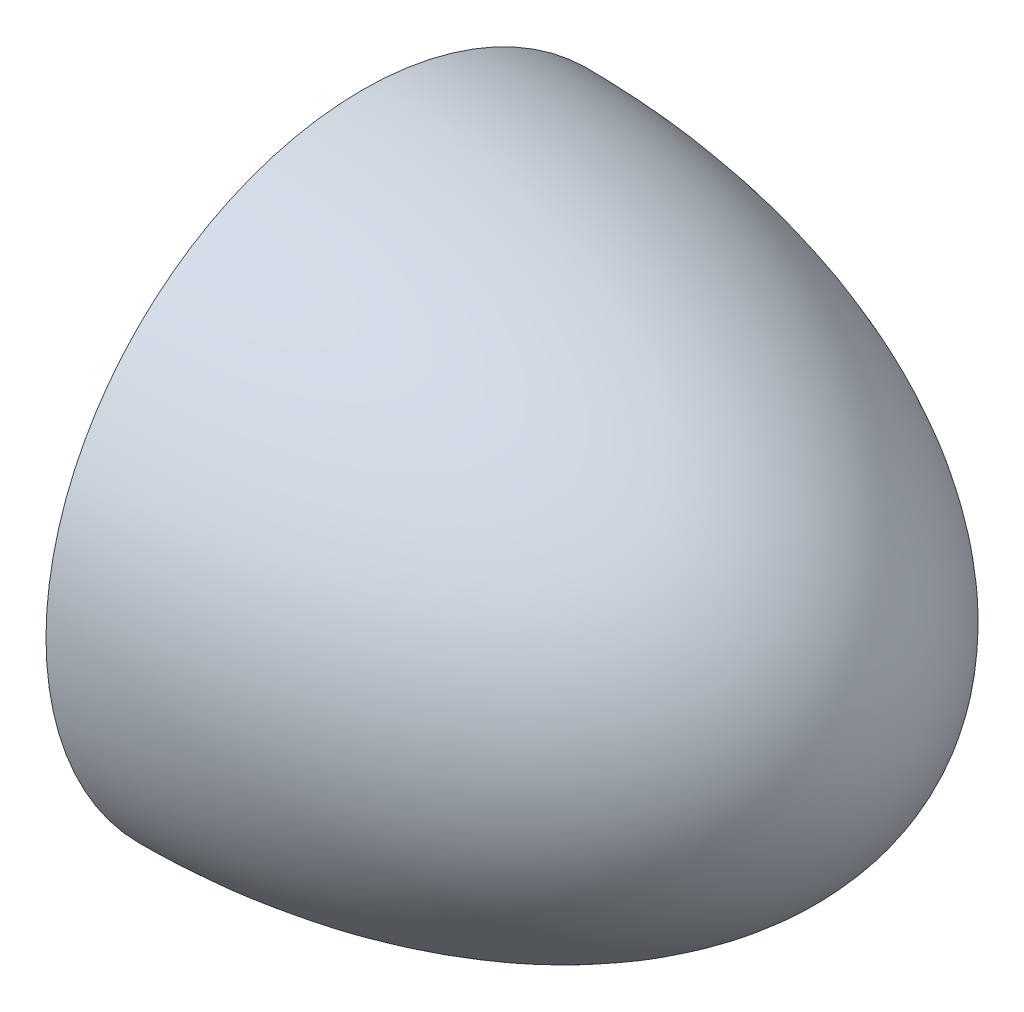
ISO-10303-21;
HEADER;
FILE_DESCRIPTION(('STEP AP214'),'2;1');
FILE_NAME('part.step','',(''),(''),'','','');
FILE_SCHEMA(('AUTOMOTIVE_DESIGN { 1 0 10303 214 1 1 1 1 }'));
ENDSEC;
DATA;
#1=APPLICATION_CONTEXT('core data for automotive mechanical design processes');
#2=APPLICATION_PROTOCOL_DEFINITION('international standard','automotive_design',2000,#1);
#3=PRODUCT_CONTEXT('',#1,'mechanical');
#4=PRODUCT('Part','Part','',(#3));
#5=PRODUCT_RELATED_PRODUCT_CATEGORY('part','',(#4));
#6=PRODUCT_DEFINITION_FORMATION('','',#4);
#7=PRODUCT_DEFINITION_CONTEXT('part definition',#1,'design');
#8=PRODUCT_DEFINITION('design','',#6,#7);
#9=PRODUCT_DEFINITION_SHAPE('','',#8);
#10=(LENGTH_UNIT() NAMED_UNIT(*) SI_UNIT(.MILLI.,.METRE.));
#11=(NAMED_UNIT(*) PLANE_ANGLE_UNIT() SI_UNIT($,.RADIAN.));
#12=(NAMED_UNIT(*) SI_UNIT($,.STERADIAN.) SOLID_ANGLE_UNIT());
#13=UNCERTAINTY_MEASURE_WITH_UNIT(LENGTH_MEASURE(1.E-05),#10,'distance_accuracy_value','');
#14=(GEOMETRIC_REPRESENTATION_CONTEXT(3) GLOBAL_UNCERTAINTY_ASSIGNED_CONTEXT((#13)) GLOBAL_UNIT_ASSIGNED_CONTEXT((#10,
#11,#12)) REPRESENTATION_CONTEXT('',''));
#15=CARTESIAN_POINT('',(0.,0.,0.));
#16=DIRECTION('',(0.,0.,1.));
#17=DIRECTION('',(1.,0.,0.));
#18=AXIS2_PLACEMENT_3D('',#15,#16,#17);
#19=CARTESIAN_POINT('',(0.,0.,0.));
#20=DIRECTION('',(0.,0.,1.));
#21=DIRECTION('',(1.,0.,0.));
#22=AXIS2_PLACEMENT_3D('',#19,#20,#21);
#23=ELLIPSE('',#22,9.58,5.74);
#24=TRIMMED_CURVE('',#23,(PARAMETER_VALUE(0.)),(PARAMETER_VALUE(3.14159265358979)),.T.,.PARAMETER.);
#25=CARTESIAN_POINT('',(0.,0.,0.));
#26=DIRECTION('',(-1.,0.,0.));
#27=AXIS1_PLACEMENT('',#25,#26);
#28=SURFACE_OF_REVOLUTION('',#24,#27);
#29=CARTESIAN_POINT('',(0.,0.,0.));
#30=DIRECTION('',(-1.,0.,0.));
#31=DIRECTION('',(0.,0.,1.));
#32=AXIS2_PLACEMENT_3D('',#29,#30,#31);
#33=CIRCLE('',#32,5.74);
#34=CARTESIAN_POINT('',(0.,0.,5.74));
#35=VERTEX_POINT('',#34);
#36=EDGE_CURVE('E11',#35,#35,#33,.T.);
#37=ORIENTED_EDGE('',*,*,#36,.F.);
#38=EDGE_LOOP('',(#37));
#39=FACE_BOUND('',#38,.T.);
#40=CARTESIAN_POINT('',(9.58,0.,0.));
#41=VERTEX_POINT('',#40);
#42=VERTEX_LOOP('',#41);
#43=FACE_BOUND('',#42,.T.);
#44=ADVANCED_FACE('F32',(#39,#43),#28,.T.);
#45=CARTESIAN_POINT('',(0.,5.74,0.));
#46=DIRECTION('',(1.,0.,0.));
#47=DIRECTION('',(0.,0.,-1.));
#48=AXIS2_PLACEMENT_3D('',#45,#46,#47);
#49=PLANE('',#48);
#50=ORIENTED_EDGE('',*,*,#36,.T.);
#51=EDGE_LOOP('',(#50));
#52=FACE_BOUND('',#51,.T.);
#53=ADVANCED_FACE('F41',(#52),#49,.F.);
#54=CLOSED_SHELL('',(#44,#53));
#55=MANIFOLD_SOLID_BREP('B2',#54);
#56=ADVANCED_BREP_SHAPE_REPRESENTATION('',(#18,#55),#14);
#57=SHAPE_DEFINITION_REPRESENTATION(#9,#56);
ENDSEC;
END-ISO-10303-21;
